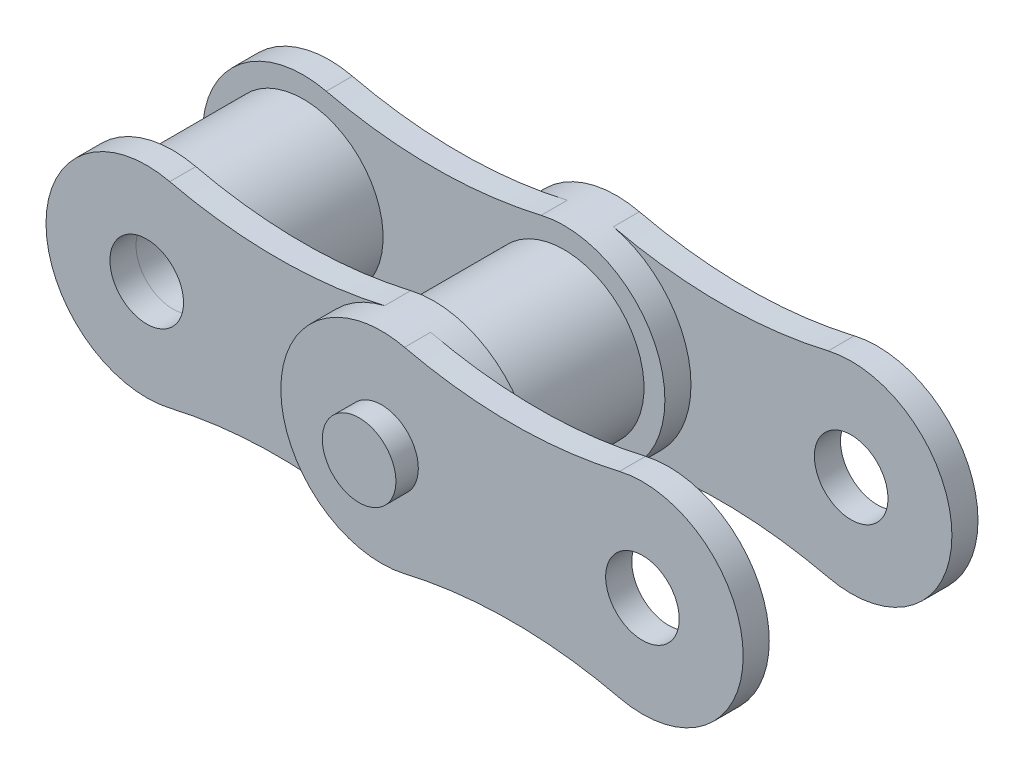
ISO-10303-21;
HEADER;
FILE_DESCRIPTION(('STEP AP214'),'2;1');
FILE_NAME('part.step','',(''),(''),'','','');
FILE_SCHEMA(('AUTOMOTIVE_DESIGN { 1 0 10303 214 1 1 1 1 }'));
ENDSEC;
DATA;
#1=APPLICATION_CONTEXT('core data for automotive mechanical design processes');
#2=APPLICATION_PROTOCOL_DEFINITION('international standard','automotive_design',2000,#1);
#3=PRODUCT_CONTEXT('',#1,'mechanical');
#4=PRODUCT('Part','Part','',(#3));
#5=PRODUCT_RELATED_PRODUCT_CATEGORY('part','',(#4));
#6=PRODUCT_DEFINITION_FORMATION('','',#4);
#7=PRODUCT_DEFINITION_CONTEXT('part definition',#1,'design');
#8=PRODUCT_DEFINITION('design','',#6,#7);
#9=PRODUCT_DEFINITION_SHAPE('','',#8);
#10=(LENGTH_UNIT() NAMED_UNIT(*) SI_UNIT(.MILLI.,.METRE.));
#11=(NAMED_UNIT(*) PLANE_ANGLE_UNIT() SI_UNIT($,.RADIAN.));
#12=(NAMED_UNIT(*) SI_UNIT($,.STERADIAN.) SOLID_ANGLE_UNIT());
#13=UNCERTAINTY_MEASURE_WITH_UNIT(LENGTH_MEASURE(1.E-05),#10,'distance_accuracy_value','');
#14=(GEOMETRIC_REPRESENTATION_CONTEXT(3) GLOBAL_UNCERTAINTY_ASSIGNED_CONTEXT((#13)) GLOBAL_UNIT_ASSIGNED_CONTEXT((#10,
#11,#12)) REPRESENTATION_CONTEXT('',''));
#15=CARTESIAN_POINT('',(0.,0.,0.));
#16=DIRECTION('',(0.,0.,1.));
#17=DIRECTION('',(1.,0.,0.));
#18=AXIS2_PLACEMENT_3D('',#15,#16,#17);
#19=CARTESIAN_POINT('',(3.175,13.5251485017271,-4.445));
#20=DIRECTION('',(0.,0.,-1.));
#21=DIRECTION('',(1.,0.,0.));
#22=AXIS2_PLACEMENT_3D('',#19,#20,#21);
#23=PLANE('',#22);
#24=CARTESIAN_POINT('',(-6.35,0.,-4.445));
#25=DIRECTION('',(0.,0.,1.));
#26=DIRECTION('',(1.,0.,0.));
#27=AXIS2_PLACEMENT_3D('',#24,#25,#26);
#28=CIRCLE('',#27,1.7907);
#29=CARTESIAN_POINT('',(-4.5593,0.,-4.445));
#30=VERTEX_POINT('',#29);
#31=EDGE_CURVE('E285',#30,#30,#28,.T.);
#32=ORIENTED_EDGE('',*,*,#31,.T.);
#33=EDGE_LOOP('',(#32));
#34=FACE_BOUND('',#33,.T.);
#35=CARTESIAN_POINT('',(6.35,0.,-4.445));
#36=DIRECTION('',(0.,0.,-1.));
#37=DIRECTION('',(-1.,0.,0.));
#38=AXIS2_PLACEMENT_3D('',#35,#36,#37);
#39=CIRCLE('',#38,4.9022);
#40=CARTESIAN_POINT('',(5.22967365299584,-4.77246620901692,-4.445));
#41=VERTEX_POINT('',#40);
#42=CARTESIAN_POINT('',(5.22967365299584,4.77246620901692,-4.445));
#43=VERTEX_POINT('',#42);
#44=EDGE_CURVE('E11',#41,#43,#39,.T.);
#45=ORIENTED_EDGE('',*,*,#44,.F.);
#46=CARTESIAN_POINT('',(0.,-27.0502970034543,-4.445));
#47=DIRECTION('',(0.,0.,-1.));
#48=DIRECTION('',(1.,0.,0.));
#49=AXIS2_PLACEMENT_3D('',#46,#47,#48);
#50=CIRCLE('',#49,22.8834270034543);
#51=CARTESIAN_POINT('',(-5.22967365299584,-4.77246620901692,-4.445));
#52=VERTEX_POINT('',#51);
#53=EDGE_CURVE('E297',#52,#41,#50,.T.);
#54=ORIENTED_EDGE('',*,*,#53,.F.);
#55=CARTESIAN_POINT('',(-6.35,0.,-4.445));
#56=DIRECTION('',(0.,0.,1.));
#57=DIRECTION('',(1.,0.,0.));
#58=AXIS2_PLACEMENT_3D('',#55,#56,#57);
#59=CIRCLE('',#58,4.9022);
#60=CARTESIAN_POINT('',(-5.22967365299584,4.77246620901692,-4.445));
#61=VERTEX_POINT('',#60);
#62=EDGE_CURVE('E294',#61,#52,#59,.T.);
#63=ORIENTED_EDGE('',*,*,#62,.F.);
#64=CARTESIAN_POINT('',(0.,27.0502970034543,-4.445));
#65=DIRECTION('',(0.,0.,-1.));
#66=DIRECTION('',(1.,0.,0.));
#67=AXIS2_PLACEMENT_3D('',#64,#65,#66);
#68=CIRCLE('',#67,22.8834270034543);
#69=EDGE_CURVE('E291',#43,#61,#68,.T.);
#70=ORIENTED_EDGE('',*,*,#69,.F.);
#71=EDGE_LOOP('',(#45,#54,#63,#70));
#72=FACE_BOUND('',#71,.T.);
#73=ADVANCED_FACE('F37',(#34,#72),#23,.T.);
#74=CARTESIAN_POINT('',(3.175,13.5251485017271,-3.175));
#75=DIRECTION('',(0.,0.,-1.));
#76=DIRECTION('',(1.,0.,0.));
#77=AXIS2_PLACEMENT_3D('',#74,#75,#76);
#78=PLANE('',#77);
#79=CARTESIAN_POINT('',(0.,27.0502970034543,-3.175));
#80=DIRECTION('',(0.,0.,-1.));
#81=DIRECTION('',(1.,0.,0.));
#82=AXIS2_PLACEMENT_3D('',#79,#80,#81);
#83=CIRCLE('',#82,22.8834270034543);
#84=CARTESIAN_POINT('',(5.22967365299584,4.77246620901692,-3.175));
#85=VERTEX_POINT('',#84);
#86=CARTESIAN_POINT('',(-5.22967365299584,4.77246620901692,-3.175));
#87=VERTEX_POINT('',#86);
#88=EDGE_CURVE('E288',#85,#87,#83,.T.);
#89=ORIENTED_EDGE('',*,*,#88,.T.);
#90=CARTESIAN_POINT('',(-6.35,0.,-3.175));
#91=DIRECTION('',(0.,0.,1.));
#92=DIRECTION('',(1.,0.,0.));
#93=AXIS2_PLACEMENT_3D('',#90,#91,#92);
#94=CIRCLE('',#93,4.9022);
#95=CARTESIAN_POINT('',(-5.22967365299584,-4.77246620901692,-3.175));
#96=VERTEX_POINT('',#95);
#97=EDGE_CURVE('E305',#87,#96,#94,.T.);
#98=ORIENTED_EDGE('',*,*,#97,.T.);
#99=CARTESIAN_POINT('',(0.,-27.0502970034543,-3.175));
#100=DIRECTION('',(0.,0.,-1.));
#101=DIRECTION('',(1.,0.,0.));
#102=AXIS2_PLACEMENT_3D('',#99,#100,#101);
#103=CIRCLE('',#102,22.8834270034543);
#104=CARTESIAN_POINT('',(5.22967365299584,-4.77246620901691,-3.175));
#105=VERTEX_POINT('',#104);
#106=EDGE_CURVE('E308',#96,#105,#103,.T.);
#107=ORIENTED_EDGE('',*,*,#106,.T.);
#108=CARTESIAN_POINT('',(6.35,0.,-3.175));
#109=DIRECTION('',(0.,0.,1.));
#110=DIRECTION('',(1.,0.,0.));
#111=AXIS2_PLACEMENT_3D('',#108,#109,#110);
#112=CIRCLE('',#111,4.9022);
#113=EDGE_CURVE('E295',#105,#85,#112,.T.);
#114=ORIENTED_EDGE('',*,*,#113,.T.);
#115=EDGE_LOOP('',(#89,#98,#107,#114));
#116=FACE_BOUND('',#115,.T.);
#117=CARTESIAN_POINT('',(-6.35,0.,-3.175));
#118=DIRECTION('',(0.,0.,-1.));
#119=DIRECTION('',(-1.,0.,0.));
#120=AXIS2_PLACEMENT_3D('',#117,#118,#119);
#121=CIRCLE('',#120,3.8862);
#122=CARTESIAN_POINT('',(-10.2362,0.,-3.175));
#123=VERTEX_POINT('',#122);
#124=EDGE_CURVE('E317',#123,#123,#121,.F.);
#125=ORIENTED_EDGE('',*,*,#124,.F.);
#126=EDGE_LOOP('',(#125));
#127=FACE_BOUND('',#126,.T.);
#128=CARTESIAN_POINT('',(6.35,0.,-3.175));
#129=DIRECTION('',(0.,0.,-1.));
#130=DIRECTION('',(-1.,0.,0.));
#131=AXIS2_PLACEMENT_3D('',#128,#129,#130);
#132=CIRCLE('',#131,3.8862);
#133=CARTESIAN_POINT('',(2.4638,0.,-3.175));
#134=VERTEX_POINT('',#133);
#135=EDGE_CURVE('E41',#134,#134,#132,.F.);
#136=ORIENTED_EDGE('',*,*,#135,.F.);
#137=EDGE_LOOP('',(#136));
#138=FACE_BOUND('',#137,.T.);
#139=ADVANCED_FACE('F326',(#116,#127,#138),#78,.F.);
#140=CARTESIAN_POINT('',(-6.35,0.,-3.175));
#141=DIRECTION('',(0.,0.,1.));
#142=DIRECTION('',(1.,0.,0.));
#143=AXIS2_PLACEMENT_3D('',#140,#141,#142);
#144=CIRCLE('',#143,1.8161);
#145=CARTESIAN_POINT('',(-4.5339,0.,-3.175));
#146=VERTEX_POINT('',#145);
#147=EDGE_CURVE('E228',#146,#146,#144,.T.);
#148=ORIENTED_EDGE('',*,*,#147,.T.);
#149=EDGE_LOOP('',(#148));
#150=FACE_BOUND('',#149,.T.);
#151=CARTESIAN_POINT('',(-6.35,0.,-3.175));
#152=DIRECTION('',(0.,0.,1.));
#153=DIRECTION('',(1.,0.,0.));
#154=AXIS2_PLACEMENT_3D('',#151,#152,#153);
#155=CIRCLE('',#154,1.7907);
#156=CARTESIAN_POINT('',(-4.5593,0.,-3.175));
#157=VERTEX_POINT('',#156);
#158=EDGE_CURVE('E284',#157,#157,#155,.T.);
#159=ORIENTED_EDGE('',*,*,#158,.F.);
#160=EDGE_LOOP('',(#159));
#161=FACE_BOUND('',#160,.T.);
#162=ADVANCED_FACE('F328',(#150,#161),#78,.F.);
#163=CARTESIAN_POINT('',(0.,27.0502970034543,-4.445));
#164=DIRECTION('',(0.,0.,1.));
#165=DIRECTION('',(-1.,0.,0.));
#166=AXIS2_PLACEMENT_3D('',#163,#164,#165);
#167=CYLINDRICAL_SURFACE('',#166,22.8834270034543);
#168=ORIENTED_EDGE('',*,*,#88,.F.);
#169=DIRECTION('',(0.,0.,1.));
#170=VECTOR('',#169,1.);
#171=CARTESIAN_POINT('',(5.22967365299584,4.77246620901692,-4.445));
#172=LINE('',#171,#170);
#173=EDGE_CURVE('E80',#43,#85,#172,.T.);
#174=ORIENTED_EDGE('',*,*,#173,.F.);
#175=ORIENTED_EDGE('',*,*,#69,.T.);
#176=DIRECTION('',(0.,0.,1.));
#177=VECTOR('',#176,1.);
#178=CARTESIAN_POINT('',(-5.22967365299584,4.77246620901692,-4.445));
#179=LINE('',#178,#177);
#180=EDGE_CURVE('E86',#61,#87,#179,.T.);
#181=ORIENTED_EDGE('',*,*,#180,.T.);
#182=EDGE_LOOP('',(#168,#174,#175,#181));
#183=FACE_BOUND('',#182,.T.);
#184=ADVANCED_FACE('F39',(#183),#167,.F.);
#185=CARTESIAN_POINT('',(-6.35,0.,-4.445));
#186=DIRECTION('',(0.,0.,1.));
#187=DIRECTION('',(-1.,0.,0.));
#188=AXIS2_PLACEMENT_3D('',#185,#186,#187);
#189=CYLINDRICAL_SURFACE('',#188,4.9022);
#190=ORIENTED_EDGE('',*,*,#97,.F.);
#191=ORIENTED_EDGE('',*,*,#180,.F.);
#192=ORIENTED_EDGE('',*,*,#62,.T.);
#193=DIRECTION('',(0.,0.,1.));
#194=VECTOR('',#193,1.);
#195=CARTESIAN_POINT('',(-5.22967365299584,-4.77246620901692,-4.445));
#196=LINE('',#195,#194);
#197=EDGE_CURVE('E315',#52,#96,#196,.T.);
#198=ORIENTED_EDGE('',*,*,#197,.T.);
#199=EDGE_LOOP('',(#190,#191,#192,#198));
#200=FACE_BOUND('',#199,.T.);
#201=ADVANCED_FACE('F520',(#200),#189,.T.);
#202=CARTESIAN_POINT('',(0.,-27.0502970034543,-4.445));
#203=DIRECTION('',(0.,0.,1.));
#204=DIRECTION('',(-1.,0.,0.));
#205=AXIS2_PLACEMENT_3D('',#202,#203,#204);
#206=CYLINDRICAL_SURFACE('',#205,22.8834270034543);
#207=ORIENTED_EDGE('',*,*,#106,.F.);
#208=ORIENTED_EDGE('',*,*,#197,.F.);
#209=ORIENTED_EDGE('',*,*,#53,.T.);
#210=DIRECTION('',(0.,0.,1.));
#211=VECTOR('',#210,1.);
#212=CARTESIAN_POINT('',(5.22967365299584,-4.77246620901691,-4.445));
#213=LINE('',#212,#211);
#214=EDGE_CURVE('E313',#41,#105,#213,.T.);
#215=ORIENTED_EDGE('',*,*,#214,.T.);
#216=EDGE_LOOP('',(#207,#208,#209,#215));
#217=FACE_BOUND('',#216,.T.);
#218=ADVANCED_FACE('F510',(#217),#206,.F.);
#219=CARTESIAN_POINT('',(6.35,0.,-4.445));
#220=DIRECTION('',(0.,0.,1.));
#221=DIRECTION('',(-1.,0.,0.));
#222=AXIS2_PLACEMENT_3D('',#219,#220,#221);
#223=CYLINDRICAL_SURFACE('',#222,4.9022);
#224=DIRECTION('',(0.,0.,1.));
#225=VECTOR('',#224,1.);
#226=CARTESIAN_POINT('',(7.47032634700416,-4.77246620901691,-5.715));
#227=LINE('',#226,#225);
#228=CARTESIAN_POINT('',(7.47032634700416,-4.77246620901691,-5.715));
#229=VERTEX_POINT('',#228);
#230=CARTESIAN_POINT('',(7.47032634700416,-4.77246620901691,-4.445));
#231=VERTEX_POINT('',#230);
#232=EDGE_CURVE('E190',#229,#231,#227,.T.);
#233=ORIENTED_EDGE('',*,*,#232,.T.);
#234=CARTESIAN_POINT('',(6.35,0.,-4.445));
#235=DIRECTION('',(0.,0.,1.));
#236=DIRECTION('',(1.,0.,0.));
#237=AXIS2_PLACEMENT_3D('',#234,#235,#236);
#238=CIRCLE('',#237,4.9022);
#239=CARTESIAN_POINT('',(7.47032634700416,4.77246620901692,-4.445));
#240=VERTEX_POINT('',#239);
#241=EDGE_CURVE('E300',#231,#240,#238,.T.);
#242=ORIENTED_EDGE('',*,*,#241,.T.);
#243=DIRECTION('',(0.,0.,1.));
#244=VECTOR('',#243,1.);
#245=CARTESIAN_POINT('',(7.47032634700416,4.77246620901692,-5.715));
#246=LINE('',#245,#244);
#247=CARTESIAN_POINT('',(7.47032634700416,4.77246620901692,-5.715));
#248=VERTEX_POINT('',#247);
#249=EDGE_CURVE('E409',#248,#240,#246,.T.);
#250=ORIENTED_EDGE('',*,*,#249,.F.);
#251=CARTESIAN_POINT('',(6.35,0.,-5.715));
#252=DIRECTION('',(0.,0.,-1.));
#253=DIRECTION('',(-1.,0.,0.));
#254=AXIS2_PLACEMENT_3D('',#251,#252,#253);
#255=CIRCLE('',#254,4.9022);
#256=EDGE_CURVE('E177',#229,#248,#255,.T.);
#257=ORIENTED_EDGE('',*,*,#256,.F.);
#258=EDGE_LOOP('',(#233,#242,#250,#257));
#259=FACE_BOUND('',#258,.T.);
#260=ORIENTED_EDGE('',*,*,#113,.F.);
#261=ORIENTED_EDGE('',*,*,#214,.F.);
#262=ORIENTED_EDGE('',*,*,#44,.T.);
#263=ORIENTED_EDGE('',*,*,#173,.T.);
#264=EDGE_LOOP('',(#260,#261,#262,#263));
#265=FACE_BOUND('',#264,.T.);
#266=ADVANCED_FACE('F418',(#259,#265),#223,.T.);
#267=CARTESIAN_POINT('',(-6.35,0.,-4.445));
#268=DIRECTION('',(0.,0.,1.));
#269=DIRECTION('',(-1.,0.,0.));
#270=AXIS2_PLACEMENT_3D('',#267,#268,#269);
#271=CYLINDRICAL_SURFACE('',#270,1.7907);
#272=ORIENTED_EDGE('',*,*,#31,.F.);
#273=EDGE_LOOP('',(#272));
#274=FACE_BOUND('',#273,.T.);
#275=ORIENTED_EDGE('',*,*,#158,.T.);
#276=EDGE_LOOP('',(#275));
#277=FACE_BOUND('',#276,.T.);
#278=ADVANCED_FACE('F502',(#274,#277),#271,.F.);
#279=CARTESIAN_POINT('',(3.175,13.5251485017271,3.175));
#280=DIRECTION('',(0.,0.,1.));
#281=DIRECTION('',(1.,0.,0.));
#282=AXIS2_PLACEMENT_3D('',#279,#280,#281);
#283=PLANE('',#282);
#284=CARTESIAN_POINT('',(0.,27.0502970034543,3.175));
#285=DIRECTION('',(0.,0.,-1.));
#286=DIRECTION('',(1.,0.,0.));
#287=AXIS2_PLACEMENT_3D('',#284,#285,#286);
#288=CIRCLE('',#287,22.8834270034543);
#289=CARTESIAN_POINT('',(5.22967365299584,4.77246620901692,3.175));
#290=VERTEX_POINT('',#289);
#291=CARTESIAN_POINT('',(-5.22967365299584,4.77246620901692,3.175));
#292=VERTEX_POINT('',#291);
#293=EDGE_CURVE('E244',#290,#292,#288,.T.);
#294=ORIENTED_EDGE('',*,*,#293,.F.);
#295=CARTESIAN_POINT('',(6.35,0.,3.175));
#296=DIRECTION('',(0.,0.,1.));
#297=DIRECTION('',(1.,0.,0.));
#298=AXIS2_PLACEMENT_3D('',#295,#296,#297);
#299=CIRCLE('',#298,4.9022);
#300=CARTESIAN_POINT('',(5.22967365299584,-4.77246620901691,3.175));
#301=VERTEX_POINT('',#300);
#302=EDGE_CURVE('E251',#301,#290,#299,.T.);
#303=ORIENTED_EDGE('',*,*,#302,.F.);
#304=CARTESIAN_POINT('',(0.,-27.0502970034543,3.175));
#305=DIRECTION('',(0.,0.,-1.));
#306=DIRECTION('',(1.,0.,0.));
#307=AXIS2_PLACEMENT_3D('',#304,#305,#306);
#308=CIRCLE('',#307,22.8834270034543);
#309=CARTESIAN_POINT('',(-5.22967365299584,-4.77246620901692,3.175));
#310=VERTEX_POINT('',#309);
#311=EDGE_CURVE('E261',#310,#301,#308,.T.);
#312=ORIENTED_EDGE('',*,*,#311,.F.);
#313=CARTESIAN_POINT('',(-6.35,0.,3.175));
#314=DIRECTION('',(0.,0.,1.));
#315=DIRECTION('',(1.,0.,0.));
#316=AXIS2_PLACEMENT_3D('',#313,#314,#315);
#317=CIRCLE('',#316,4.9022);
#318=EDGE_CURVE('E259',#292,#310,#317,.T.);
#319=ORIENTED_EDGE('',*,*,#318,.F.);
#320=EDGE_LOOP('',(#294,#303,#312,#319));
#321=FACE_BOUND('',#320,.T.);
#322=CARTESIAN_POINT('',(6.35,0.,3.175));
#323=DIRECTION('',(0.,0.,1.));
#324=DIRECTION('',(1.,0.,0.));
#325=AXIS2_PLACEMENT_3D('',#322,#323,#324);
#326=CIRCLE('',#325,3.8862);
#327=CARTESIAN_POINT('',(10.2362,0.,3.175));
#328=VERTEX_POINT('',#327);
#329=EDGE_CURVE('E275',#328,#328,#326,.F.);
#330=ORIENTED_EDGE('',*,*,#329,.F.);
#331=EDGE_LOOP('',(#330));
#332=FACE_BOUND('',#331,.T.);
#333=CARTESIAN_POINT('',(-6.35,0.,3.175));
#334=DIRECTION('',(0.,0.,1.));
#335=DIRECTION('',(1.,0.,0.));
#336=AXIS2_PLACEMENT_3D('',#333,#334,#335);
#337=CIRCLE('',#336,3.8862);
#338=CARTESIAN_POINT('',(-2.4638,0.,3.175));
#339=VERTEX_POINT('',#338);
#340=EDGE_CURVE('E278',#339,#339,#337,.F.);
#341=ORIENTED_EDGE('',*,*,#340,.F.);
#342=EDGE_LOOP('',(#341));
#343=FACE_BOUND('',#342,.T.);
#344=ADVANCED_FACE('F367',(#321,#332,#343),#283,.F.);
#345=CARTESIAN_POINT('',(-6.35,0.,3.175));
#346=DIRECTION('',(0.,0.,1.));
#347=DIRECTION('',(1.,0.,0.));
#348=AXIS2_PLACEMENT_3D('',#345,#346,#347);
#349=CIRCLE('',#348,1.8161);
#350=CARTESIAN_POINT('',(-4.5339,0.,3.175));
#351=VERTEX_POINT('',#350);
#352=EDGE_CURVE('E229',#351,#351,#349,.T.);
#353=ORIENTED_EDGE('',*,*,#352,.F.);
#354=EDGE_LOOP('',(#353));
#355=FACE_BOUND('',#354,.T.);
#356=CARTESIAN_POINT('',(-6.35,0.,3.175));
#357=DIRECTION('',(0.,0.,1.));
#358=DIRECTION('',(1.,0.,0.));
#359=AXIS2_PLACEMENT_3D('',#356,#357,#358);
#360=CIRCLE('',#359,1.7907);
#361=CARTESIAN_POINT('',(-4.5593,0.,3.175));
#362=VERTEX_POINT('',#361);
#363=EDGE_CURVE('E238',#362,#362,#360,.T.);
#364=ORIENTED_EDGE('',*,*,#363,.T.);
#365=EDGE_LOOP('',(#364));
#366=FACE_BOUND('',#365,.T.);
#367=ADVANCED_FACE('F368',(#355,#366),#283,.F.);
#368=CARTESIAN_POINT('',(3.175,13.5251485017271,4.445));
#369=DIRECTION('',(0.,0.,1.));
#370=DIRECTION('',(1.,0.,0.));
#371=AXIS2_PLACEMENT_3D('',#368,#369,#370);
#372=PLANE('',#371);
#373=CARTESIAN_POINT('',(6.35,0.,4.445));
#374=DIRECTION('',(0.,0.,1.));
#375=DIRECTION('',(1.,0.,0.));
#376=AXIS2_PLACEMENT_3D('',#373,#374,#375);
#377=CIRCLE('',#376,4.9022);
#378=CARTESIAN_POINT('',(5.22967365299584,4.77246620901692,4.445));
#379=VERTEX_POINT('',#378);
#380=CARTESIAN_POINT('',(5.22967365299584,-4.77246620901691,4.445));
#381=VERTEX_POINT('',#380);
#382=EDGE_CURVE('E47',#379,#381,#377,.T.);
#383=ORIENTED_EDGE('',*,*,#382,.F.);
#384=CARTESIAN_POINT('',(0.,27.0502970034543,4.445));
#385=DIRECTION('',(0.,0.,-1.));
#386=DIRECTION('',(1.,0.,0.));
#387=AXIS2_PLACEMENT_3D('',#384,#385,#386);
#388=CIRCLE('',#387,22.8834270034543);
#389=CARTESIAN_POINT('',(-5.22967365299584,4.77246620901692,4.445));
#390=VERTEX_POINT('',#389);
#391=EDGE_CURVE('E247',#379,#390,#388,.T.);
#392=ORIENTED_EDGE('',*,*,#391,.T.);
#393=CARTESIAN_POINT('',(-6.35,0.,4.445));
#394=DIRECTION('',(0.,0.,1.));
#395=DIRECTION('',(1.,0.,0.));
#396=AXIS2_PLACEMENT_3D('',#393,#394,#395);
#397=CIRCLE('',#396,4.9022);
#398=CARTESIAN_POINT('',(-5.22967365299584,-4.77246620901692,4.445));
#399=VERTEX_POINT('',#398);
#400=EDGE_CURVE('E250',#390,#399,#397,.T.);
#401=ORIENTED_EDGE('',*,*,#400,.T.);
#402=CARTESIAN_POINT('',(0.,-27.0502970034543,4.445));
#403=DIRECTION('',(0.,0.,-1.));
#404=DIRECTION('',(1.,0.,0.));
#405=AXIS2_PLACEMENT_3D('',#402,#403,#404);
#406=CIRCLE('',#405,22.8834270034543);
#407=EDGE_CURVE('E253',#399,#381,#406,.T.);
#408=ORIENTED_EDGE('',*,*,#407,.T.);
#409=EDGE_LOOP('',(#383,#392,#401,#408));
#410=FACE_BOUND('',#409,.T.);
#411=CARTESIAN_POINT('',(-6.35,0.,4.445));
#412=DIRECTION('',(0.,0.,1.));
#413=DIRECTION('',(1.,0.,0.));
#414=AXIS2_PLACEMENT_3D('',#411,#412,#413);
#415=CIRCLE('',#414,1.7907);
#416=CARTESIAN_POINT('',(-4.5593,0.,4.445));
#417=VERTEX_POINT('',#416);
#418=EDGE_CURVE('E241',#417,#417,#415,.T.);
#419=ORIENTED_EDGE('',*,*,#418,.F.);
#420=EDGE_LOOP('',(#419));
#421=FACE_BOUND('',#420,.T.);
#422=ADVANCED_FACE('F483',(#410,#421),#372,.T.);
#423=CARTESIAN_POINT('',(0.,27.0502970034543,4.445));
#424=DIRECTION('',(0.,0.,-1.));
#425=DIRECTION('',(-1.,0.,0.));
#426=AXIS2_PLACEMENT_3D('',#423,#424,#425);
#427=CYLINDRICAL_SURFACE('',#426,22.8834270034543);
#428=ORIENTED_EDGE('',*,*,#293,.T.);
#429=DIRECTION('',(0.,0.,-1.));
#430=VECTOR('',#429,1.);
#431=CARTESIAN_POINT('',(-5.22967365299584,4.77246620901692,4.445));
#432=LINE('',#431,#430);
#433=EDGE_CURVE('E272',#390,#292,#432,.T.);
#434=ORIENTED_EDGE('',*,*,#433,.F.);
#435=ORIENTED_EDGE('',*,*,#391,.F.);
#436=DIRECTION('',(0.,0.,-1.));
#437=VECTOR('',#436,1.);
#438=CARTESIAN_POINT('',(5.22967365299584,4.77246620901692,4.445));
#439=LINE('',#438,#437);
#440=EDGE_CURVE('E256',#379,#290,#439,.T.);
#441=ORIENTED_EDGE('',*,*,#440,.T.);
#442=EDGE_LOOP('',(#428,#434,#435,#441));
#443=FACE_BOUND('',#442,.T.);
#444=ADVANCED_FACE('F485',(#443),#427,.F.);
#445=CARTESIAN_POINT('',(-6.35,0.,4.445));
#446=DIRECTION('',(0.,0.,-1.));
#447=DIRECTION('',(-1.,0.,0.));
#448=AXIS2_PLACEMENT_3D('',#445,#446,#447);
#449=CYLINDRICAL_SURFACE('',#448,4.9022);
#450=ORIENTED_EDGE('',*,*,#318,.T.);
#451=DIRECTION('',(0.,0.,-1.));
#452=VECTOR('',#451,1.);
#453=CARTESIAN_POINT('',(-5.22967365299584,-4.77246620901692,4.445));
#454=LINE('',#453,#452);
#455=EDGE_CURVE('E269',#399,#310,#454,.T.);
#456=ORIENTED_EDGE('',*,*,#455,.F.);
#457=ORIENTED_EDGE('',*,*,#400,.F.);
#458=ORIENTED_EDGE('',*,*,#433,.T.);
#459=EDGE_LOOP('',(#450,#456,#457,#458));
#460=FACE_BOUND('',#459,.T.);
#461=ADVANCED_FACE('F494',(#460),#449,.T.);
#462=CARTESIAN_POINT('',(0.,-27.0502970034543,4.445));
#463=DIRECTION('',(0.,0.,-1.));
#464=DIRECTION('',(-1.,0.,0.));
#465=AXIS2_PLACEMENT_3D('',#462,#463,#464);
#466=CYLINDRICAL_SURFACE('',#465,22.8834270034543);
#467=ORIENTED_EDGE('',*,*,#311,.T.);
#468=DIRECTION('',(0.,0.,-1.));
#469=VECTOR('',#468,1.);
#470=CARTESIAN_POINT('',(5.22967365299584,-4.77246620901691,4.445));
#471=LINE('',#470,#469);
#472=EDGE_CURVE('E266',#381,#301,#471,.T.);
#473=ORIENTED_EDGE('',*,*,#472,.F.);
#474=ORIENTED_EDGE('',*,*,#407,.F.);
#475=ORIENTED_EDGE('',*,*,#455,.T.);
#476=EDGE_LOOP('',(#467,#473,#474,#475));
#477=FACE_BOUND('',#476,.T.);
#478=ADVANCED_FACE('F490',(#477),#466,.F.);
#479=CARTESIAN_POINT('',(6.35,0.,4.445));
#480=DIRECTION('',(0.,0.,-1.));
#481=DIRECTION('',(-1.,0.,0.));
#482=AXIS2_PLACEMENT_3D('',#479,#480,#481);
#483=CYLINDRICAL_SURFACE('',#482,4.9022);
#484=ORIENTED_EDGE('',*,*,#440,.F.);
#485=ORIENTED_EDGE('',*,*,#382,.T.);
#486=ORIENTED_EDGE('',*,*,#472,.T.);
#487=ORIENTED_EDGE('',*,*,#302,.T.);
#488=EDGE_LOOP('',(#484,#485,#486,#487));
#489=FACE_BOUND('',#488,.T.);
#490=DIRECTION('',(0.,0.,-1.));
#491=VECTOR('',#490,1.);
#492=CARTESIAN_POINT('',(7.47032634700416,4.77246620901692,5.715));
#493=LINE('',#492,#491);
#494=CARTESIAN_POINT('',(7.47032634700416,4.77246620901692,5.715));
#495=VERTEX_POINT('',#494);
#496=CARTESIAN_POINT('',(7.47032634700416,4.77246620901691,4.445));
#497=VERTEX_POINT('',#496);
#498=EDGE_CURVE('E226',#495,#497,#493,.T.);
#499=ORIENTED_EDGE('',*,*,#498,.T.);
#500=CARTESIAN_POINT('',(6.35,0.,4.445));
#501=DIRECTION('',(0.,0.,1.));
#502=DIRECTION('',(1.,0.,0.));
#503=AXIS2_PLACEMENT_3D('',#500,#501,#502);
#504=CIRCLE('',#503,4.9022);
#505=CARTESIAN_POINT('',(7.47032634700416,-4.77246620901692,4.445));
#506=VERTEX_POINT('',#505);
#507=EDGE_CURVE('E55',#506,#497,#504,.T.);
#508=ORIENTED_EDGE('',*,*,#507,.F.);
#509=DIRECTION('',(0.,0.,-1.));
#510=VECTOR('',#509,1.);
#511=CARTESIAN_POINT('',(7.47032634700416,-4.77246620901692,5.715));
#512=LINE('',#511,#510);
#513=CARTESIAN_POINT('',(7.47032634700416,-4.77246620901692,5.715));
#514=VERTEX_POINT('',#513);
#515=EDGE_CURVE('E223',#514,#506,#512,.T.);
#516=ORIENTED_EDGE('',*,*,#515,.F.);
#517=CARTESIAN_POINT('',(6.35,0.,5.715));
#518=DIRECTION('',(0.,0.,1.));
#519=DIRECTION('',(1.,0.,0.));
#520=AXIS2_PLACEMENT_3D('',#517,#518,#519);
#521=CIRCLE('',#520,4.9022);
#522=EDGE_CURVE('E203',#495,#514,#521,.T.);
#523=ORIENTED_EDGE('',*,*,#522,.F.);
#524=EDGE_LOOP('',(#499,#508,#516,#523));
#525=FACE_BOUND('',#524,.T.);
#526=ADVANCED_FACE('F481',(#489,#525),#483,.T.);
#527=CARTESIAN_POINT('',(-6.35,0.,4.445));
#528=DIRECTION('',(0.,0.,-1.));
#529=DIRECTION('',(-1.,0.,0.));
#530=AXIS2_PLACEMENT_3D('',#527,#528,#529);
#531=CYLINDRICAL_SURFACE('',#530,1.7907);
#532=ORIENTED_EDGE('',*,*,#418,.T.);
#533=EDGE_LOOP('',(#532));
#534=FACE_BOUND('',#533,.T.);
#535=ORIENTED_EDGE('',*,*,#363,.F.);
#536=EDGE_LOOP('',(#535));
#537=FACE_BOUND('',#536,.T.);
#538=ADVANCED_FACE('F477',(#534,#537),#531,.F.);
#539=CARTESIAN_POINT('',(6.35,0.,3.175));
#540=DIRECTION('',(0.,0.,-1.));
#541=DIRECTION('',(-1.,0.,0.));
#542=AXIS2_PLACEMENT_3D('',#539,#540,#541);
#543=CYLINDRICAL_SURFACE('',#542,3.8862);
#544=ORIENTED_EDGE('',*,*,#329,.T.);
#545=EDGE_LOOP('',(#544));
#546=FACE_BOUND('',#545,.T.);
#547=ORIENTED_EDGE('',*,*,#135,.T.);
#548=EDGE_LOOP('',(#547));
#549=FACE_BOUND('',#548,.T.);
#550=ADVANCED_FACE('F324',(#546,#549),#543,.T.);
#551=CARTESIAN_POINT('',(-6.35,0.,3.175));
#552=DIRECTION('',(0.,0.,-1.));
#553=DIRECTION('',(-1.,0.,0.));
#554=AXIS2_PLACEMENT_3D('',#551,#552,#553);
#555=CYLINDRICAL_SURFACE('',#554,3.8862);
#556=ORIENTED_EDGE('',*,*,#340,.T.);
#557=EDGE_LOOP('',(#556));
#558=FACE_BOUND('',#557,.T.);
#559=ORIENTED_EDGE('',*,*,#124,.T.);
#560=EDGE_LOOP('',(#559));
#561=FACE_BOUND('',#560,.T.);
#562=ADVANCED_FACE('F470',(#558,#561),#555,.T.);
#563=CARTESIAN_POINT('',(-6.35,0.,3.175));
#564=DIRECTION('',(0.,0.,-1.));
#565=DIRECTION('',(-1.,0.,0.));
#566=AXIS2_PLACEMENT_3D('',#563,#564,#565);
#567=CYLINDRICAL_SURFACE('',#566,1.8161);
#568=ORIENTED_EDGE('',*,*,#352,.T.);
#569=EDGE_LOOP('',(#568));
#570=FACE_BOUND('',#569,.T.);
#571=ORIENTED_EDGE('',*,*,#147,.F.);
#572=EDGE_LOOP('',(#571));
#573=FACE_BOUND('',#572,.T.);
#574=ADVANCED_FACE('F456',(#570,#573),#567,.F.);
#575=CARTESIAN_POINT('',(15.875,13.5251485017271,4.445));
#576=DIRECTION('',(0.,0.,1.));
#577=DIRECTION('',(1.,0.,0.));
#578=AXIS2_PLACEMENT_3D('',#575,#576,#577);
#579=PLANE('',#578);
#580=CARTESIAN_POINT('',(19.05,0.,4.445));
#581=DIRECTION('',(0.,0.,1.));
#582=DIRECTION('',(1.,0.,0.));
#583=AXIS2_PLACEMENT_3D('',#580,#581,#582);
#584=CIRCLE('',#583,1.79069999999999);
#585=CARTESIAN_POINT('',(20.8407,0.,4.445));
#586=VERTEX_POINT('',#585);
#587=EDGE_CURVE('E188',#586,#586,#584,.T.);
#588=ORIENTED_EDGE('',*,*,#587,.T.);
#589=EDGE_LOOP('',(#588));
#590=FACE_BOUND('',#589,.T.);
#591=CARTESIAN_POINT('',(12.7,-27.0502970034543,4.445));
#592=DIRECTION('',(0.,0.,-1.));
#593=DIRECTION('',(1.,0.,0.));
#594=AXIS2_PLACEMENT_3D('',#591,#592,#593);
#595=CIRCLE('',#594,22.8834270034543);
#596=CARTESIAN_POINT('',(17.9296736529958,-4.77246620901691,4.445));
#597=VERTEX_POINT('',#596);
#598=EDGE_CURVE('E213',#506,#597,#595,.T.);
#599=ORIENTED_EDGE('',*,*,#598,.F.);
#600=ORIENTED_EDGE('',*,*,#507,.T.);
#601=CARTESIAN_POINT('',(12.7,27.0502970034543,4.445));
#602=DIRECTION('',(0.,0.,-1.));
#603=DIRECTION('',(1.,0.,0.));
#604=AXIS2_PLACEMENT_3D('',#601,#602,#603);
#605=CIRCLE('',#604,22.8834270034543);
#606=CARTESIAN_POINT('',(17.9296736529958,4.77246620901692,4.445));
#607=VERTEX_POINT('',#606);
#608=EDGE_CURVE('E197',#607,#497,#605,.T.);
#609=ORIENTED_EDGE('',*,*,#608,.F.);
#610=CARTESIAN_POINT('',(19.05,0.,4.445));
#611=DIRECTION('',(0.,0.,1.));
#612=DIRECTION('',(1.,0.,0.));
#613=AXIS2_PLACEMENT_3D('',#610,#611,#612);
#614=CIRCLE('',#613,4.9022);
#615=EDGE_CURVE('E204',#597,#607,#614,.T.);
#616=ORIENTED_EDGE('',*,*,#615,.F.);
#617=EDGE_LOOP('',(#599,#600,#609,#616));
#618=FACE_BOUND('',#617,.T.);
#619=ADVANCED_FACE('F452',(#590,#618),#579,.F.);
#620=CARTESIAN_POINT('',(15.875,13.5251485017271,5.715));
#621=DIRECTION('',(0.,0.,1.));
#622=DIRECTION('',(1.,0.,0.));
#623=AXIS2_PLACEMENT_3D('',#620,#621,#622);
#624=PLANE('',#623);
#625=CARTESIAN_POINT('',(19.05,0.,5.715));
#626=DIRECTION('',(0.,0.,1.));
#627=DIRECTION('',(1.,0.,0.));
#628=AXIS2_PLACEMENT_3D('',#625,#626,#627);
#629=CIRCLE('',#628,1.79069999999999);
#630=CARTESIAN_POINT('',(20.8407,0.,5.715));
#631=VERTEX_POINT('',#630);
#632=EDGE_CURVE('E194',#631,#631,#629,.T.);
#633=ORIENTED_EDGE('',*,*,#632,.F.);
#634=EDGE_LOOP('',(#633));
#635=FACE_BOUND('',#634,.T.);
#636=CARTESIAN_POINT('',(12.7,27.0502970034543,5.715));
#637=DIRECTION('',(0.,0.,-1.));
#638=DIRECTION('',(1.,0.,0.));
#639=AXIS2_PLACEMENT_3D('',#636,#637,#638);
#640=CIRCLE('',#639,22.8834270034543);
#641=CARTESIAN_POINT('',(17.9296736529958,4.77246620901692,5.715));
#642=VERTEX_POINT('',#641);
#643=EDGE_CURVE('E200',#642,#495,#640,.T.);
#644=ORIENTED_EDGE('',*,*,#643,.T.);
#645=ORIENTED_EDGE('',*,*,#522,.T.);
#646=CARTESIAN_POINT('',(12.7,-27.0502970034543,5.715));
#647=DIRECTION('',(0.,0.,-1.));
#648=DIRECTION('',(1.,0.,0.));
#649=AXIS2_PLACEMENT_3D('',#646,#647,#648);
#650=CIRCLE('',#649,22.8834270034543);
#651=CARTESIAN_POINT('',(17.9296736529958,-4.77246620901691,5.715));
#652=VERTEX_POINT('',#651);
#653=EDGE_CURVE('E206',#514,#652,#650,.T.);
#654=ORIENTED_EDGE('',*,*,#653,.T.);
#655=CARTESIAN_POINT('',(19.05,0.,5.715));
#656=DIRECTION('',(0.,0.,1.));
#657=DIRECTION('',(1.,0.,0.));
#658=AXIS2_PLACEMENT_3D('',#655,#656,#657);
#659=CIRCLE('',#658,4.9022);
#660=EDGE_CURVE('E208',#652,#642,#659,.T.);
#661=ORIENTED_EDGE('',*,*,#660,.T.);
#662=EDGE_LOOP('',(#644,#645,#654,#661));
#663=FACE_BOUND('',#662,.T.);
#664=CARTESIAN_POINT('',(6.35,0.,5.715));
#665=DIRECTION('',(0.,0.,1.));
#666=DIRECTION('',(1.,0.,0.));
#667=AXIS2_PLACEMENT_3D('',#664,#665,#666);
#668=CIRCLE('',#667,1.7907);
#669=CARTESIAN_POINT('',(8.1407,0.,5.715));
#670=VERTEX_POINT('',#669);
#671=EDGE_CURVE('E185',#670,#670,#668,.T.);
#672=ORIENTED_EDGE('',*,*,#671,.F.);
#673=EDGE_LOOP('',(#672));
#674=FACE_BOUND('',#673,.T.);
#675=ADVANCED_FACE('F448',(#635,#663,#674),#624,.T.);
#676=CARTESIAN_POINT('',(12.7,27.0502970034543,5.715));
#677=DIRECTION('',(0.,0.,-1.));
#678=DIRECTION('',(-1.,0.,0.));
#679=AXIS2_PLACEMENT_3D('',#676,#677,#678);
#680=CYLINDRICAL_SURFACE('',#679,22.8834270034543);
#681=ORIENTED_EDGE('',*,*,#608,.T.);
#682=ORIENTED_EDGE('',*,*,#498,.F.);
#683=ORIENTED_EDGE('',*,*,#643,.F.);
#684=DIRECTION('',(0.,0.,-1.));
#685=VECTOR('',#684,1.);
#686=CARTESIAN_POINT('',(17.9296736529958,4.77246620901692,5.715));
#687=LINE('',#686,#685);
#688=EDGE_CURVE('E210',#642,#607,#687,.T.);
#689=ORIENTED_EDGE('',*,*,#688,.T.);
#690=EDGE_LOOP('',(#681,#682,#683,#689));
#691=FACE_BOUND('',#690,.T.);
#692=ADVANCED_FACE('F451',(#691),#680,.F.);
#693=CARTESIAN_POINT('',(12.7,-27.0502970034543,5.715));
#694=DIRECTION('',(0.,0.,-1.));
#695=DIRECTION('',(-1.,0.,0.));
#696=AXIS2_PLACEMENT_3D('',#693,#694,#695);
#697=CYLINDRICAL_SURFACE('',#696,22.8834270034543);
#698=ORIENTED_EDGE('',*,*,#598,.T.);
#699=DIRECTION('',(0.,0.,-1.));
#700=VECTOR('',#699,1.);
#701=CARTESIAN_POINT('',(17.9296736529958,-4.77246620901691,5.715));
#702=LINE('',#701,#700);
#703=EDGE_CURVE('E220',#652,#597,#702,.T.);
#704=ORIENTED_EDGE('',*,*,#703,.F.);
#705=ORIENTED_EDGE('',*,*,#653,.F.);
#706=ORIENTED_EDGE('',*,*,#515,.T.);
#707=EDGE_LOOP('',(#698,#704,#705,#706));
#708=FACE_BOUND('',#707,.T.);
#709=ADVANCED_FACE('F460',(#708),#697,.F.);
#710=CARTESIAN_POINT('',(19.05,0.,5.715));
#711=DIRECTION('',(0.,0.,-1.));
#712=DIRECTION('',(-1.,0.,0.));
#713=AXIS2_PLACEMENT_3D('',#710,#711,#712);
#714=CYLINDRICAL_SURFACE('',#713,4.9022);
#715=ORIENTED_EDGE('',*,*,#615,.T.);
#716=ORIENTED_EDGE('',*,*,#688,.F.);
#717=ORIENTED_EDGE('',*,*,#660,.F.);
#718=ORIENTED_EDGE('',*,*,#703,.T.);
#719=EDGE_LOOP('',(#715,#716,#717,#718));
#720=FACE_BOUND('',#719,.T.);
#721=ADVANCED_FACE('F446',(#720),#714,.T.);
#722=CARTESIAN_POINT('',(19.05,0.,5.715));
#723=DIRECTION('',(0.,0.,-1.));
#724=DIRECTION('',(-1.,0.,0.));
#725=AXIS2_PLACEMENT_3D('',#722,#723,#724);
#726=CYLINDRICAL_SURFACE('',#725,1.79069999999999);
#727=ORIENTED_EDGE('',*,*,#632,.T.);
#728=EDGE_LOOP('',(#727));
#729=FACE_BOUND('',#728,.T.);
#730=ORIENTED_EDGE('',*,*,#587,.F.);
#731=EDGE_LOOP('',(#730));
#732=FACE_BOUND('',#731,.T.);
#733=ADVANCED_FACE('F437',(#729,#732),#726,.F.);
#734=CARTESIAN_POINT('',(9.525,13.5251485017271,-5.715));
#735=DIRECTION('',(0.,0.,-1.));
#736=DIRECTION('',(-1.,0.,0.));
#737=AXIS2_PLACEMENT_3D('',#734,#735,#736);
#738=PLANE('',#737);
#739=CARTESIAN_POINT('',(19.05,0.,-5.715));
#740=DIRECTION('',(0.,0.,-1.));
#741=DIRECTION('',(-1.,0.,0.));
#742=AXIS2_PLACEMENT_3D('',#739,#740,#741);
#743=CIRCLE('',#742,1.7907);
#744=CARTESIAN_POINT('',(17.2593,0.,-5.715));
#745=VERTEX_POINT('',#744);
#746=EDGE_CURVE('E402',#745,#745,#743,.T.);
#747=ORIENTED_EDGE('',*,*,#746,.F.);
#748=EDGE_LOOP('',(#747));
#749=FACE_BOUND('',#748,.T.);
#750=CARTESIAN_POINT('',(12.7,27.0502970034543,-5.715));
#751=DIRECTION('',(0.,0.,1.));
#752=DIRECTION('',(-1.,0.,0.));
#753=AXIS2_PLACEMENT_3D('',#750,#751,#752);
#754=CIRCLE('',#753,22.8834270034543);
#755=CARTESIAN_POINT('',(17.9296736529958,4.77246620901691,-5.715));
#756=VERTEX_POINT('',#755);
#757=EDGE_CURVE('E171',#248,#756,#754,.T.);
#758=ORIENTED_EDGE('',*,*,#757,.T.);
#759=CARTESIAN_POINT('',(19.05,0.,-5.715));
#760=DIRECTION('',(0.,0.,-1.));
#761=DIRECTION('',(-1.,0.,0.));
#762=AXIS2_PLACEMENT_3D('',#759,#760,#761);
#763=CIRCLE('',#762,4.9022);
#764=CARTESIAN_POINT('',(17.9296736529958,-4.77246620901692,-5.715));
#765=VERTEX_POINT('',#764);
#766=EDGE_CURVE('E160',#756,#765,#763,.T.);
#767=ORIENTED_EDGE('',*,*,#766,.T.);
#768=CARTESIAN_POINT('',(12.7,-27.0502970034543,-5.715));
#769=DIRECTION('',(0.,0.,1.));
#770=DIRECTION('',(-1.,0.,0.));
#771=AXIS2_PLACEMENT_3D('',#768,#769,#770);
#772=CIRCLE('',#771,22.8834270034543);
#773=EDGE_CURVE('E170',#765,#229,#772,.T.);
#774=ORIENTED_EDGE('',*,*,#773,.T.);
#775=ORIENTED_EDGE('',*,*,#256,.T.);
#776=EDGE_LOOP('',(#758,#767,#774,#775));
#777=FACE_BOUND('',#776,.T.);
#778=CARTESIAN_POINT('',(6.35,0.,-5.715));
#779=DIRECTION('',(0.,0.,-1.));
#780=DIRECTION('',(-1.,0.,0.));
#781=AXIS2_PLACEMENT_3D('',#778,#779,#780);
#782=CIRCLE('',#781,1.7907);
#783=CARTESIAN_POINT('',(4.5593,0.,-5.715));
#784=VERTEX_POINT('',#783);
#785=EDGE_CURVE('E388',#784,#784,#782,.T.);
#786=ORIENTED_EDGE('',*,*,#785,.F.);
#787=EDGE_LOOP('',(#786));
#788=FACE_BOUND('',#787,.T.);
#789=ADVANCED_FACE('F174',(#749,#777,#788),#738,.T.);
#790=CARTESIAN_POINT('',(9.525,13.5251485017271,-4.445));
#791=DIRECTION('',(0.,0.,-1.));
#792=DIRECTION('',(-1.,0.,0.));
#793=AXIS2_PLACEMENT_3D('',#790,#791,#792);
#794=PLANE('',#793);
#795=ORIENTED_EDGE('',*,*,#241,.F.);
#796=CARTESIAN_POINT('',(12.7,-27.0502970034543,-4.445));
#797=DIRECTION('',(0.,0.,1.));
#798=DIRECTION('',(-1.,0.,0.));
#799=AXIS2_PLACEMENT_3D('',#796,#797,#798);
#800=CIRCLE('',#799,22.8834270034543);
#801=CARTESIAN_POINT('',(17.9296736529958,-4.77246620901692,-4.445));
#802=VERTEX_POINT('',#801);
#803=EDGE_CURVE('E180',#802,#231,#800,.T.);
#804=ORIENTED_EDGE('',*,*,#803,.F.);
#805=CARTESIAN_POINT('',(19.05,0.,-4.445));
#806=DIRECTION('',(0.,0.,-1.));
#807=DIRECTION('',(-1.,0.,0.));
#808=AXIS2_PLACEMENT_3D('',#805,#806,#807);
#809=CIRCLE('',#808,4.9022);
#810=CARTESIAN_POINT('',(17.9296736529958,4.77246620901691,-4.445));
#811=VERTEX_POINT('',#810);
#812=EDGE_CURVE('E411',#811,#802,#809,.T.);
#813=ORIENTED_EDGE('',*,*,#812,.F.);
#814=CARTESIAN_POINT('',(12.7,27.0502970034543,-4.445));
#815=DIRECTION('',(0.,0.,1.));
#816=DIRECTION('',(-1.,0.,0.));
#817=AXIS2_PLACEMENT_3D('',#814,#815,#816);
#818=CIRCLE('',#817,22.8834270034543);
#819=EDGE_CURVE('E184',#240,#811,#818,.T.);
#820=ORIENTED_EDGE('',*,*,#819,.F.);
#821=EDGE_LOOP('',(#795,#804,#813,#820));
#822=FACE_BOUND('',#821,.T.);
#823=CARTESIAN_POINT('',(19.05,0.,-4.445));
#824=DIRECTION('',(0.,0.,-1.));
#825=DIRECTION('',(-1.,0.,0.));
#826=AXIS2_PLACEMENT_3D('',#823,#824,#825);
#827=CIRCLE('',#826,1.7907);
#828=CARTESIAN_POINT('',(17.2593,0.,-4.445));
#829=VERTEX_POINT('',#828);
#830=EDGE_CURVE('E401',#829,#829,#827,.T.);
#831=ORIENTED_EDGE('',*,*,#830,.T.);
#832=EDGE_LOOP('',(#831));
#833=FACE_BOUND('',#832,.T.);
#834=ADVANCED_FACE('F423',(#822,#833),#794,.F.);
#835=CARTESIAN_POINT('',(12.7,27.0502970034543,-5.715));
#836=DIRECTION('',(0.,0.,1.));
#837=DIRECTION('',(1.,0.,0.));
#838=AXIS2_PLACEMENT_3D('',#835,#836,#837);
#839=CYLINDRICAL_SURFACE('',#838,22.8834270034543);
#840=ORIENTED_EDGE('',*,*,#819,.T.);
#841=DIRECTION('',(0.,0.,1.));
#842=VECTOR('',#841,1.);
#843=CARTESIAN_POINT('',(17.9296736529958,4.77246620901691,-5.715));
#844=LINE('',#843,#842);
#845=EDGE_CURVE('E164',#756,#811,#844,.T.);
#846=ORIENTED_EDGE('',*,*,#845,.F.);
#847=ORIENTED_EDGE('',*,*,#757,.F.);
#848=ORIENTED_EDGE('',*,*,#249,.T.);
#849=EDGE_LOOP('',(#840,#846,#847,#848));
#850=FACE_BOUND('',#849,.T.);
#851=ADVANCED_FACE('F182',(#850),#839,.F.);
#852=CARTESIAN_POINT('',(19.05,0.,-5.715));
#853=DIRECTION('',(0.,0.,1.));
#854=DIRECTION('',(1.,0.,0.));
#855=AXIS2_PLACEMENT_3D('',#852,#853,#854);
#856=CYLINDRICAL_SURFACE('',#855,4.9022);
#857=ORIENTED_EDGE('',*,*,#812,.T.);
#858=DIRECTION('',(0.,0.,1.));
#859=VECTOR('',#858,1.);
#860=CARTESIAN_POINT('',(17.9296736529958,-4.77246620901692,-5.715));
#861=LINE('',#860,#859);
#862=EDGE_CURVE('E167',#765,#802,#861,.T.);
#863=ORIENTED_EDGE('',*,*,#862,.F.);
#864=ORIENTED_EDGE('',*,*,#766,.F.);
#865=ORIENTED_EDGE('',*,*,#845,.T.);
#866=EDGE_LOOP('',(#857,#863,#864,#865));
#867=FACE_BOUND('',#866,.T.);
#868=ADVANCED_FACE('F162',(#867),#856,.T.);
#869=CARTESIAN_POINT('',(12.7,-27.0502970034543,-5.715));
#870=DIRECTION('',(0.,0.,1.));
#871=DIRECTION('',(1.,0.,0.));
#872=AXIS2_PLACEMENT_3D('',#869,#870,#871);
#873=CYLINDRICAL_SURFACE('',#872,22.8834270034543);
#874=ORIENTED_EDGE('',*,*,#803,.T.);
#875=ORIENTED_EDGE('',*,*,#232,.F.);
#876=ORIENTED_EDGE('',*,*,#773,.F.);
#877=ORIENTED_EDGE('',*,*,#862,.T.);
#878=EDGE_LOOP('',(#874,#875,#876,#877));
#879=FACE_BOUND('',#878,.T.);
#880=ADVANCED_FACE('F420',(#879),#873,.F.);
#881=CARTESIAN_POINT('',(19.05,0.,-5.715));
#882=DIRECTION('',(0.,0.,1.));
#883=DIRECTION('',(1.,0.,0.));
#884=AXIS2_PLACEMENT_3D('',#881,#882,#883);
#885=CYLINDRICAL_SURFACE('',#884,1.7907);
#886=ORIENTED_EDGE('',*,*,#746,.T.);
#887=EDGE_LOOP('',(#886));
#888=FACE_BOUND('',#887,.T.);
#889=ORIENTED_EDGE('',*,*,#830,.F.);
#890=EDGE_LOOP('',(#889));
#891=FACE_BOUND('',#890,.T.);
#892=ADVANCED_FACE('F383',(#888,#891),#885,.F.);
#893=CARTESIAN_POINT('',(6.35,0.,-6.7056));
#894=DIRECTION('',(0.,0.,-1.));
#895=DIRECTION('',(-1.,0.,0.));
#896=AXIS2_PLACEMENT_3D('',#893,#894,#895);
#897=PLANE('',#896);
#898=CARTESIAN_POINT('',(6.35,0.,-6.7056));
#899=DIRECTION('',(0.,0.,-1.));
#900=DIRECTION('',(-1.,0.,0.));
#901=AXIS2_PLACEMENT_3D('',#898,#899,#900);
#902=CIRCLE('',#901,1.7907);
#903=CARTESIAN_POINT('',(4.5593,0.,-6.7056));
#904=VERTEX_POINT('',#903);
#905=EDGE_CURVE('E391',#904,#904,#902,.T.);
#906=ORIENTED_EDGE('',*,*,#905,.T.);
#907=EDGE_LOOP('',(#906));
#908=FACE_BOUND('',#907,.T.);
#909=ADVANCED_FACE('F375',(#908),#897,.T.);
#910=CARTESIAN_POINT('',(6.35,0.,6.8072));
#911=DIRECTION('',(0.,0.,-1.));
#912=DIRECTION('',(-1.,0.,0.));
#913=AXIS2_PLACEMENT_3D('',#910,#911,#912);
#914=CYLINDRICAL_SURFACE('',#913,1.7907);
#915=ORIENTED_EDGE('',*,*,#785,.T.);
#916=EDGE_LOOP('',(#915));
#917=FACE_BOUND('',#916,.T.);
#918=ORIENTED_EDGE('',*,*,#905,.F.);
#919=EDGE_LOOP('',(#918));
#920=FACE_BOUND('',#919,.T.);
#921=ADVANCED_FACE('F361',(#917,#920),#914,.T.);
#922=CARTESIAN_POINT('',(6.35,0.,6.8072));
#923=DIRECTION('',(0.,0.,-1.));
#924=DIRECTION('',(-1.,0.,0.));
#925=AXIS2_PLACEMENT_3D('',#922,#923,#924);
#926=PLANE('',#925);
#927=CARTESIAN_POINT('',(6.35,0.,6.8072));
#928=DIRECTION('',(0.,0.,-1.));
#929=DIRECTION('',(-1.,0.,0.));
#930=AXIS2_PLACEMENT_3D('',#927,#928,#929);
#931=CIRCLE('',#930,1.7907);
#932=CARTESIAN_POINT('',(4.5593,0.,6.8072));
#933=VERTEX_POINT('',#932);
#934=EDGE_CURVE('E392',#933,#933,#931,.T.);
#935=ORIENTED_EDGE('',*,*,#934,.F.);
#936=EDGE_LOOP('',(#935));
#937=FACE_BOUND('',#936,.T.);
#938=ADVANCED_FACE('F372',(#937),#926,.F.);
#939=ORIENTED_EDGE('',*,*,#671,.T.);
#940=EDGE_LOOP('',(#939));
#941=FACE_BOUND('',#940,.T.);
#942=ORIENTED_EDGE('',*,*,#934,.T.);
#943=EDGE_LOOP('',(#942));
#944=FACE_BOUND('',#943,.T.);
#945=ADVANCED_FACE('F360',(#941,#944),#914,.T.);
#946=CLOSED_SHELL('',(#73,#139,#162,#184,#201,#218,#266,#278,#344,#367,#422,#444,#461,#478,#526,
#538,#550,#562,#574,#619,#675,#692,#709,#721,#733,#789,#834,#851,#868,#880,#892,#909,#921,#938,#945));
#947=CARTESIAN_POINT('',(6.35,0.,-3.175));
#948=DIRECTION('',(0.,0.,1.));
#949=DIRECTION('',(1.,0.,0.));
#950=AXIS2_PLACEMENT_3D('',#947,#948,#949);
#951=CIRCLE('',#950,1.8161);
#952=CARTESIAN_POINT('',(8.1661,0.,-3.175));
#953=VERTEX_POINT('',#952);
#954=EDGE_CURVE('E232',#953,#953,#951,.T.);
#955=ORIENTED_EDGE('',*,*,#954,.T.);
#956=EDGE_LOOP('',(#955));
#957=FACE_BOUND('',#956,.T.);
#958=CARTESIAN_POINT('',(6.35,0.,-3.175));
#959=DIRECTION('',(0.,0.,1.));
#960=DIRECTION('',(1.,0.,0.));
#961=AXIS2_PLACEMENT_3D('',#958,#959,#960);
#962=CIRCLE('',#961,1.7907);
#963=CARTESIAN_POINT('',(8.1407,0.,-3.175));
#964=VERTEX_POINT('',#963);
#965=EDGE_CURVE('E281',#964,#964,#962,.T.);
#966=ORIENTED_EDGE('',*,*,#965,.F.);
#967=EDGE_LOOP('',(#966));
#968=FACE_BOUND('',#967,.T.);
#969=ADVANCED_FACE('F331',(#957,#968),#78,.F.);
#970=CARTESIAN_POINT('',(6.35,0.,3.175));
#971=DIRECTION('',(0.,0.,-1.));
#972=DIRECTION('',(-1.,0.,0.));
#973=AXIS2_PLACEMENT_3D('',#970,#971,#972);
#974=CYLINDRICAL_SURFACE('',#973,1.8161);
#975=CARTESIAN_POINT('',(6.35,0.,3.175));
#976=DIRECTION('',(0.,0.,1.));
#977=DIRECTION('',(1.,0.,0.));
#978=AXIS2_PLACEMENT_3D('',#975,#976,#977);
#979=CIRCLE('',#978,1.8161);
#980=CARTESIAN_POINT('',(8.1661,0.,3.175));
#981=VERTEX_POINT('',#980);
#982=EDGE_CURVE('E235',#981,#981,#979,.T.);
#983=ORIENTED_EDGE('',*,*,#982,.T.);
#984=EDGE_LOOP('',(#983));
#985=FACE_BOUND('',#984,.T.);
#986=ORIENTED_EDGE('',*,*,#954,.F.);
#987=EDGE_LOOP('',(#986));
#988=FACE_BOUND('',#987,.T.);
#989=ADVANCED_FACE('F342',(#985,#988),#974,.F.);
#990=ORIENTED_EDGE('',*,*,#982,.F.);
#991=EDGE_LOOP('',(#990));
#992=FACE_BOUND('',#991,.T.);
#993=CARTESIAN_POINT('',(6.35,0.,3.175));
#994=DIRECTION('',(0.,0.,1.));
#995=DIRECTION('',(1.,0.,0.));
#996=AXIS2_PLACEMENT_3D('',#993,#994,#995);
#997=CIRCLE('',#996,1.7907);
#998=CARTESIAN_POINT('',(8.1407,0.,3.175));
#999=VERTEX_POINT('',#998);
#1000=EDGE_CURVE('E395',#999,#999,#997,.T.);
#1001=ORIENTED_EDGE('',*,*,#1000,.T.);
#1002=EDGE_LOOP('',(#1001));
#1003=FACE_BOUND('',#1002,.T.);
#1004=ADVANCED_FACE('F349',(#992,#1003),#283,.F.);
#1005=ORIENTED_EDGE('',*,*,#1000,.F.);
#1006=EDGE_LOOP('',(#1005));
#1007=FACE_BOUND('',#1006,.T.);
#1008=ORIENTED_EDGE('',*,*,#965,.T.);
#1009=EDGE_LOOP('',(#1008));
#1010=FACE_BOUND('',#1009,.T.);
#1011=ADVANCED_FACE('F356',(#1007,#1010),#914,.T.);
#1012=CLOSED_SHELL('',(#969,#989,#1004,#1011));
#1013=ORIENTED_CLOSED_SHELL('',*,#1012,.T.);
#1014=BREP_WITH_VOIDS('B2',#946,(#1013));
#1015=ADVANCED_BREP_SHAPE_REPRESENTATION('',(#18,#1014),#14);
#1016=SHAPE_DEFINITION_REPRESENTATION(#9,#1015);
ENDSEC;
END-ISO-10303-21;
